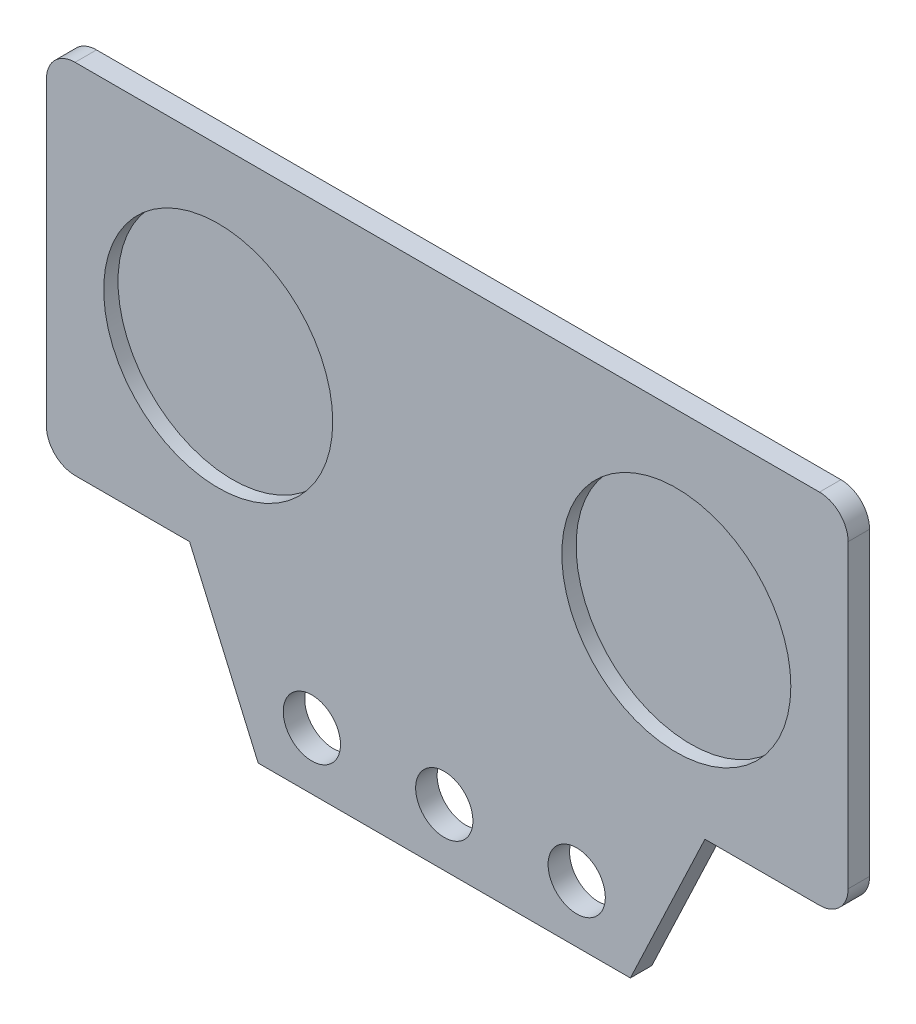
from build123d import *

# Parameters (mm, degrees)
ESQUISSE1_W                         = 56
ESQUISSE1_H                         = 36
BOSS_EXTRU_1_DEPTH                  = 1.5
ESQUISSE2_W                         = 15.208370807
ESQUISSE2_H                         = 11
ENL_V_MAT_EXTRU_1_DEPTH             = 62.345333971
ESQUISSE3_W                         = 14.791629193
ESQUISSE3_H                         = 11
ENL_V_MAT_EXTRU_2_DEPTH             = 62.345333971
D_POUILLE1_ANGLE                    = 23.538069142
D_POUILLE2_ANGLE                    = 25.337005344
DIAM_TRE_DU_PER_AGE_4_0_4_1_D       = 4
DIAM_TRE_DU_PER_AGE_16_0_16_1_D     = 16
DIAM_TRE_DU_PER_AGE_16_0_16_1_DEPTH = 1
CONG_1_R                            = 2


with BuildPart() as part:
    # Esquisse1 → Boss.-Extru.1 (new body)
    with BuildSketch(Plane.XY.offset(1.5)):
        with Locations((28, 7)):
            Rectangle(ESQUISSE1_W, ESQUISSE1_H)
    extrude(amount=-BOSS_EXTRU_1_DEPTH)

    # Esquisse2 → Enl_v. mat.-Extru.1 (cut, through all)
    with BuildSketch(Plane(origin=(0, 0, 0), x_dir=(-1, 0, 0), z_dir=(0, 0, -1))):
        with Locations((-48.395814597, -5.5)):
            Rectangle(ESQUISSE2_W, ESQUISSE2_H)
    extrude(amount=-ENL_V_MAT_EXTRU_1_DEPTH, mode=Mode.SUBTRACT)

    # Esquisse3 → Enl_v. mat.-Extru.2 (cut, through all)
    with BuildSketch(Plane(origin=(0, 0, 0), x_dir=(-1, 0, 0), z_dir=(0, 0, -1))):
        with Locations((-7.395814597, -5.5)):
            Rectangle(ESQUISSE3_W, ESQUISSE3_H)
    extrude(amount=-ENL_V_MAT_EXTRU_2_DEPTH, mode=Mode.SUBTRACT)

    # D_pouille1
    d_pouille1_faces = [part.faces().sort_by_distance(p)[0] for p in [
        (14.791629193, -5.5, 0.75),
    ]]
    draft(d_pouille1_faces, Plane(origin=(0, -11, 0), x_dir=(-1, 0, 0), z_dir=(0, -1, 0)), D_POUILLE1_ANGLE)

    # D_pouille2
    d_pouille2_faces = [part.faces().sort_by_distance(p)[0] for p in [
        (40.791629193, -5.5, 0.75),
    ]]
    draft(d_pouille2_faces, Plane(origin=(0, -11, 0), x_dir=(-1, 0, 0), z_dir=(0, -1, 0)), D_POUILLE2_ANGLE)

    # Diam_tre du per_age _4.0 _4_1 (through all)
    with Locations(Plane.XY.offset(1.5)):
        with Locations((37.041629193, -7), (18.541629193, -7), (27.791629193, -7)):
            Hole(DIAM_TRE_DU_PER_AGE_4_0_4_1_D / 2)

    # Diam_tre du per_age _16.0 _16_1
    with Locations(Plane.XY.offset(1.5)):
        with Locations((44, 12.250901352), (12, 12.250901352)):
            Hole(DIAM_TRE_DU_PER_AGE_16_0_16_1_D / 2, depth=DIAM_TRE_DU_PER_AGE_16_0_16_1_DEPTH)

    # Cong_1
    cong_1_edges = [part.edges().sort_by_distance(p)[0] for p in [
        (56, 0, 0.75),
        (0, 0, 0.75),
        (0, 25, 0.75),
        (56, 25, 0.75),
    ]]
    fillet(cong_1_edges, radius=CONG_1_R)


solid = part.part
